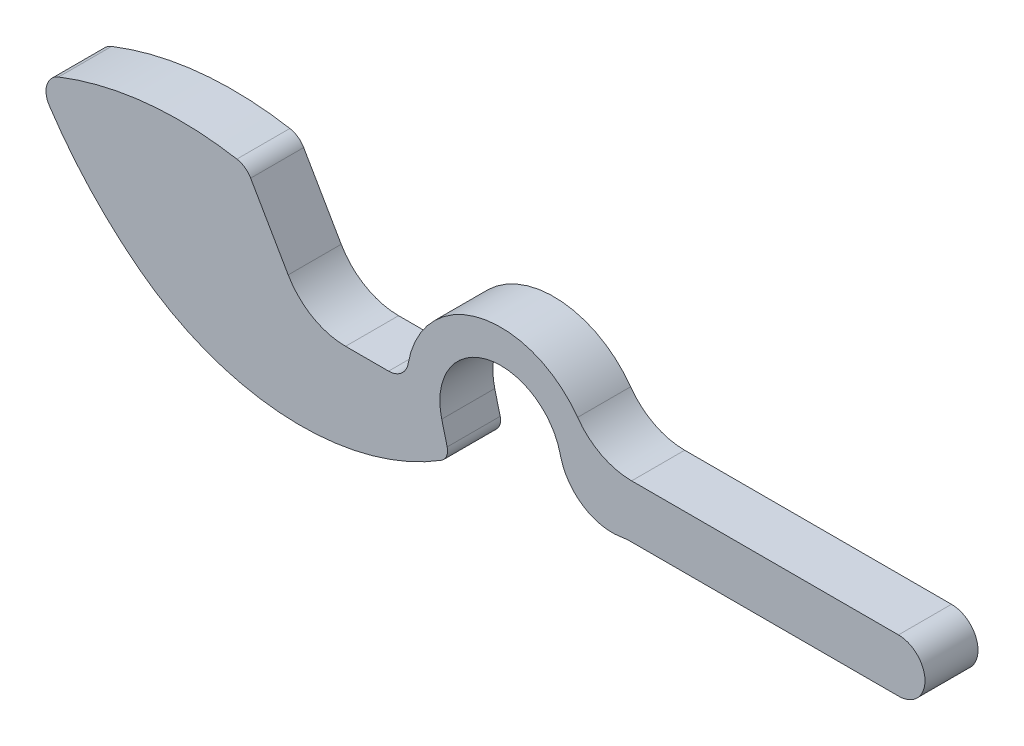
ISO-10303-21;
HEADER;
FILE_DESCRIPTION(('STEP AP214'),'2;1');
FILE_NAME('part.step','',(''),(''),'','','');
FILE_SCHEMA(('AUTOMOTIVE_DESIGN { 1 0 10303 214 1 1 1 1 }'));
ENDSEC;
DATA;
#1=APPLICATION_CONTEXT('core data for automotive mechanical design processes');
#2=APPLICATION_PROTOCOL_DEFINITION('international standard','automotive_design',2000,#1);
#3=PRODUCT_CONTEXT('',#1,'mechanical');
#4=PRODUCT('Part','Part','',(#3));
#5=PRODUCT_RELATED_PRODUCT_CATEGORY('part','',(#4));
#6=PRODUCT_DEFINITION_FORMATION('','',#4);
#7=PRODUCT_DEFINITION_CONTEXT('part definition',#1,'design');
#8=PRODUCT_DEFINITION('design','',#6,#7);
#9=PRODUCT_DEFINITION_SHAPE('','',#8);
#10=(LENGTH_UNIT() NAMED_UNIT(*) SI_UNIT(.MILLI.,.METRE.));
#11=(NAMED_UNIT(*) PLANE_ANGLE_UNIT() SI_UNIT($,.RADIAN.));
#12=(NAMED_UNIT(*) SI_UNIT($,.STERADIAN.) SOLID_ANGLE_UNIT());
#13=UNCERTAINTY_MEASURE_WITH_UNIT(LENGTH_MEASURE(1.E-05),#10,'distance_accuracy_value','');
#14=(GEOMETRIC_REPRESENTATION_CONTEXT(3) GLOBAL_UNCERTAINTY_ASSIGNED_CONTEXT((#13)) GLOBAL_UNIT_ASSIGNED_CONTEXT((#10,
#11,#12)) REPRESENTATION_CONTEXT('',''));
#15=CARTESIAN_POINT('',(0.,0.,0.));
#16=DIRECTION('',(0.,0.,1.));
#17=DIRECTION('',(1.,0.,0.));
#18=AXIS2_PLACEMENT_3D('',#15,#16,#17);
#19=CARTESIAN_POINT('',(29.4701025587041,-5.39818533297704,-136.148176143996));
#20=DIRECTION('',(0.,0.,1.));
#21=DIRECTION('',(1.,0.,0.));
#22=AXIS2_PLACEMENT_3D('',#19,#20,#21);
#23=CYLINDRICAL_SURFACE('',#22,60.);
#24=CARTESIAN_POINT('',(29.4701025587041,-5.39818533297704,1.));
#25=DIRECTION('',(0.,0.,1.));
#26=DIRECTION('',(1.,0.,0.));
#27=AXIS2_PLACEMENT_3D('',#24,#25,#26);
#28=CIRCLE('',#27,60.);
#29=CARTESIAN_POINT('',(-7.03735193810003,-53.0133695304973,0.999999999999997));
#30=VERTEX_POINT('',#29);
#31=CARTESIAN_POINT('',(-20.6369281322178,-38.4025104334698,1.));
#32=VERTEX_POINT('',#31);
#33=EDGE_CURVE('E174',#30,#32,#28,.F.);
#34=ORIENTED_EDGE('',*,*,#33,.F.);
#35=DIRECTION('',(0.,0.,1.));
#36=VECTOR('',#35,1.);
#37=CARTESIAN_POINT('',(-7.03735193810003,-53.0133695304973,0.999999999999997));
#38=LINE('',#37,#36);
#39=CARTESIAN_POINT('',(-7.03735193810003,-53.0133695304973,8.99999999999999));
#40=VERTEX_POINT('',#39);
#41=EDGE_CURVE('E180',#30,#40,#38,.T.);
#42=ORIENTED_EDGE('',*,*,#41,.T.);
#43=CARTESIAN_POINT('',(29.4701025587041,-5.39818533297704,8.99999999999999));
#44=DIRECTION('',(0.,0.,1.));
#45=DIRECTION('',(1.,0.,0.));
#46=AXIS2_PLACEMENT_3D('',#43,#44,#45);
#47=CIRCLE('',#46,60.);
#48=CARTESIAN_POINT('',(-20.6369281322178,-38.4025104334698,8.99999999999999));
#49=VERTEX_POINT('',#48);
#50=EDGE_CURVE('E238',#49,#40,#47,.T.);
#51=ORIENTED_EDGE('',*,*,#50,.F.);
#52=DIRECTION('',(0.,0.,1.));
#53=VECTOR('',#52,1.);
#54=CARTESIAN_POINT('',(-20.6369281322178,-38.4025104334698,-136.148176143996));
#55=LINE('',#54,#53);
#56=EDGE_CURVE('E191',#32,#49,#55,.T.);
#57=ORIENTED_EDGE('',*,*,#56,.F.);
#58=EDGE_LOOP('',(#34,#42,#51,#57));
#59=FACE_BOUND('',#58,.T.);
#60=ADVANCED_FACE('F35',(#59),#23,.T.);
#61=CARTESIAN_POINT('',(47.5,-47.5,50.1636651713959));
#62=DIRECTION('',(0.,0.,-1.));
#63=DIRECTION('',(-1.,0.,0.));
#64=AXIS2_PLACEMENT_3D('',#61,#62,#63);
#65=CYLINDRICAL_SURFACE('',#64,14.2);
#66=DIRECTION('',(0.,0.,1.));
#67=VECTOR('',#66,1.);
#68=CARTESIAN_POINT('',(59.0825649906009,-39.2851239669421,-136.148176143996));
#69=LINE('',#68,#67);
#70=CARTESIAN_POINT('',(59.0825649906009,-39.2851239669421,1.));
#71=VERTEX_POINT('',#70);
#72=CARTESIAN_POINT('',(59.0825649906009,-39.2851239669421,8.99999999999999));
#73=VERTEX_POINT('',#72);
#74=EDGE_CURVE('E257',#71,#73,#69,.T.);
#75=ORIENTED_EDGE('',*,*,#74,.F.);
#76=CARTESIAN_POINT('',(47.5,-47.5,0.999999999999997));
#77=DIRECTION('',(0.,0.,1.));
#78=DIRECTION('',(1.,0.,0.));
#79=AXIS2_PLACEMENT_3D('',#76,#77,#78);
#80=CIRCLE('',#79,14.2);
#81=CARTESIAN_POINT('',(33.5176633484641,-45.0232558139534,1.));
#82=VERTEX_POINT('',#81);
#83=EDGE_CURVE('E272',#71,#82,#80,.T.);
#84=ORIENTED_EDGE('',*,*,#83,.T.);
#85=DIRECTION('',(0.,0.,1.));
#86=VECTOR('',#85,1.);
#87=CARTESIAN_POINT('',(33.5176633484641,-45.0232558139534,-136.148176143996));
#88=LINE('',#87,#86);
#89=CARTESIAN_POINT('',(33.5176633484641,-45.0232558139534,9.00000000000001));
#90=VERTEX_POINT('',#89);
#91=EDGE_CURVE('E255',#82,#90,#88,.T.);
#92=ORIENTED_EDGE('',*,*,#91,.T.);
#93=CARTESIAN_POINT('',(47.5,-47.5,8.99999999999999));
#94=DIRECTION('',(0.,0.,1.));
#95=DIRECTION('',(1.,0.,0.));
#96=AXIS2_PLACEMENT_3D('',#93,#94,#95);
#97=CIRCLE('',#96,14.2);
#98=EDGE_CURVE('E268',#73,#90,#97,.T.);
#99=ORIENTED_EDGE('',*,*,#98,.F.);
#100=EDGE_LOOP('',(#75,#84,#92,#99));
#101=FACE_BOUND('',#100,.T.);
#102=ADVANCED_FACE('F355',(#101),#65,.T.);
#103=CARTESIAN_POINT('',(47.5,-47.5,0.999999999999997));
#104=DIRECTION('',(0.,0.,1.));
#105=DIRECTION('',(1.,0.,0.));
#106=AXIS2_PLACEMENT_3D('',#103,#104,#105);
#107=PLANE('',#106);
#108=DIRECTION('',(0.246517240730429,-0.969138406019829,0.));
#109=VECTOR('',#108,1.);
#110=CARTESIAN_POINT('',(38.5839266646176,-49.7679586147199,0.999999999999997));
#111=LINE('',#110,#109);
#112=CARTESIAN_POINT('',(38.5839266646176,-49.7679586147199,0.999999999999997));
#113=VERTEX_POINT('',#112);
#114=CARTESIAN_POINT('',(39.4025437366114,-52.9862051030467,0.999999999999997));
#115=VERTEX_POINT('',#114);
#116=EDGE_CURVE('E294',#113,#115,#111,.T.);
#117=ORIENTED_EDGE('',*,*,#116,.T.);
#118=CARTESIAN_POINT('',(37.4642669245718,-53.4792395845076,0.999999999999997));
#119=DIRECTION('',(0.,0.,1.));
#120=DIRECTION('',(1.,0.,0.));
#121=AXIS2_PLACEMENT_3D('',#118,#119,#120);
#122=CIRCLE('',#121,2.);
#123=CARTESIAN_POINT('',(38.5254940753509,-55.1744672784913,0.999999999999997));
#124=VERTEX_POINT('',#123);
#125=EDGE_CURVE('E12',#115,#124,#122,.F.);
#126=ORIENTED_EDGE('',*,*,#125,.T.);
#127=CARTESIAN_POINT('',(17.3009510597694,-21.2699133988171,0.999999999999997));
#128=DIRECTION('',(0.,0.,-1.));
#129=DIRECTION('',(1.,0.,0.));
#130=AXIS2_PLACEMENT_3D('',#127,#128,#129);
#131=CIRCLE('',#130,40.);
#132=EDGE_CURVE('E170',#124,#30,#131,.T.);
#133=ORIENTED_EDGE('',*,*,#132,.T.);
#134=ORIENTED_EDGE('',*,*,#33,.T.);
#135=CARTESIAN_POINT('',(-18.1315765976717,-36.7522941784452,1.));
#136=DIRECTION('',(0.,0.,1.));
#137=DIRECTION('',(1.,0.,0.));
#138=AXIS2_PLACEMENT_3D('',#135,#136,#137);
#139=CIRCLE('',#138,3.);
#140=CARTESIAN_POINT('',(-19.2295508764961,-33.9604395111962,1.));
#141=VERTEX_POINT('',#140);
#142=EDGE_CURVE('E193',#32,#141,#139,.F.);
#143=ORIENTED_EDGE('',*,*,#142,.T.);
#144=CARTESIAN_POINT('',(-0.929979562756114,-80.4913506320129,1.));
#145=DIRECTION('',(0.,0.,1.));
#146=DIRECTION('',(1.,0.,0.));
#147=AXIS2_PLACEMENT_3D('',#144,#145,#146);
#148=CIRCLE('',#147,50.);
#149=CARTESIAN_POINT('',(7.66810578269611,-31.236168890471,1.));
#150=VERTEX_POINT('',#149);
#151=EDGE_CURVE('E198',#141,#150,#148,.F.);
#152=ORIENTED_EDGE('',*,*,#151,.T.);
#153=CARTESIAN_POINT('',(7.15222066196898,-34.1914797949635,1.));
#154=DIRECTION('',(0.,0.,1.));
#155=DIRECTION('',(1.,0.,0.));
#156=AXIS2_PLACEMENT_3D('',#153,#154,#155);
#157=CIRCLE('',#156,2.99999999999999);
#158=CARTESIAN_POINT('',(9.7502968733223,-32.6914797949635,1.));
#159=VERTEX_POINT('',#158);
#160=EDGE_CURVE('E320',#150,#159,#157,.F.);
#161=ORIENTED_EDGE('',*,*,#160,.T.);
#162=DIRECTION('',(0.499999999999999,-0.866025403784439,0.));
#163=VECTOR('',#162,1.);
#164=CARTESIAN_POINT('',(15.4132486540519,-42.4999999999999,1.));
#165=LINE('',#164,#163);
#166=CARTESIAN_POINT('',(15.4132486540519,-42.4999999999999,1.));
#167=VERTEX_POINT('',#166);
#168=EDGE_CURVE('E318',#159,#167,#165,.T.);
#169=ORIENTED_EDGE('',*,*,#168,.T.);
#170=CARTESIAN_POINT('',(24.0735026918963,-37.5,1.));
#171=DIRECTION('',(0.,0.,1.));
#172=DIRECTION('',(1.,0.,0.));
#173=AXIS2_PLACEMENT_3D('',#170,#171,#172);
#174=CIRCLE('',#173,9.99999999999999);
#175=CARTESIAN_POINT('',(24.0735026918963,-47.5,1.));
#176=VERTEX_POINT('',#175);
#177=EDGE_CURVE('E316',#167,#176,#174,.T.);
#178=ORIENTED_EDGE('',*,*,#177,.T.);
#179=DIRECTION('',(1.,0.,0.));
#180=VECTOR('',#179,1.);
#181=CARTESIAN_POINT('',(30.5636485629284,-47.5,1.));
#182=LINE('',#181,#180);
#183=CARTESIAN_POINT('',(30.5636485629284,-47.5,1.));
#184=VERTEX_POINT('',#183);
#185=EDGE_CURVE('E314',#176,#184,#182,.T.);
#186=ORIENTED_EDGE('',*,*,#185,.T.);
#187=CARTESIAN_POINT('',(30.5636485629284,-44.5,1.));
#188=DIRECTION('',(0.,0.,1.));
#189=DIRECTION('',(1.,0.,0.));
#190=AXIS2_PLACEMENT_3D('',#187,#188,#189);
#191=CIRCLE('',#190,3.);
#192=EDGE_CURVE('E311',#184,#82,#191,.T.);
#193=ORIENTED_EDGE('',*,*,#192,.T.);
#194=ORIENTED_EDGE('',*,*,#83,.F.);
#195=CARTESIAN_POINT('',(67.2393008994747,-33.4999999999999,1.));
#196=DIRECTION('',(0.,0.,1.));
#197=DIRECTION('',(1.,0.,0.));
#198=AXIS2_PLACEMENT_3D('',#195,#196,#197);
#199=CIRCLE('',#198,10.);
#200=CARTESIAN_POINT('',(67.2393008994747,-43.5,1.));
#201=VERTEX_POINT('',#200);
#202=EDGE_CURVE('E309',#71,#201,#199,.T.);
#203=ORIENTED_EDGE('',*,*,#202,.T.);
#204=DIRECTION('',(1.,0.,0.));
#205=VECTOR('',#204,1.);
#206=CARTESIAN_POINT('',(67.2393008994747,-43.5,1.));
#207=LINE('',#206,#205);
#208=CARTESIAN_POINT('',(107.5,-43.5,1.));
#209=VERTEX_POINT('',#208);
#210=EDGE_CURVE('E307',#201,#209,#207,.T.);
#211=ORIENTED_EDGE('',*,*,#210,.T.);
#212=CARTESIAN_POINT('',(107.5,-47.5,1.));
#213=DIRECTION('',(0.,0.,1.));
#214=DIRECTION('',(1.,0.,0.));
#215=AXIS2_PLACEMENT_3D('',#212,#213,#214);
#216=CIRCLE('',#215,4.);
#217=CARTESIAN_POINT('',(107.5,-51.5,1.));
#218=VERTEX_POINT('',#217);
#219=EDGE_CURVE('E242',#209,#218,#216,.F.);
#220=ORIENTED_EDGE('',*,*,#219,.T.);
#221=DIRECTION('',(-1.,0.,0.));
#222=VECTOR('',#221,1.);
#223=CARTESIAN_POINT('',(67.2393008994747,-51.5,1.));
#224=LINE('',#223,#222);
#225=CARTESIAN_POINT('',(67.2393008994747,-51.5,1.));
#226=VERTEX_POINT('',#225);
#227=EDGE_CURVE('E196',#218,#226,#224,.T.);
#228=ORIENTED_EDGE('',*,*,#227,.T.);
#229=CARTESIAN_POINT('',(67.2393008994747,-61.5,1.));
#230=DIRECTION('',(0.,0.,1.));
#231=DIRECTION('',(1.,0.,0.));
#232=AXIS2_PLACEMENT_3D('',#229,#230,#231);
#233=CIRCLE('',#232,10.);
#234=CARTESIAN_POINT('',(65.601936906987,-51.6349587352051,1.));
#235=VERTEX_POINT('',#234);
#236=EDGE_CURVE('E192',#226,#235,#233,.T.);
#237=ORIENTED_EDGE('',*,*,#236,.T.);
#238=CARTESIAN_POINT('',(64.2920457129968,-43.7429257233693,1.));
#239=DIRECTION('',(0.,0.,1.));
#240=DIRECTION('',(1.,0.,0.));
#241=AXIS2_PLACEMENT_3D('',#238,#239,#240);
#242=CIRCLE('',#241,8.);
#243=CARTESIAN_POINT('',(56.5389384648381,-45.7150636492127,0.999999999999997));
#244=VERTEX_POINT('',#243);
#245=EDGE_CURVE('E286',#235,#244,#242,.F.);
#246=ORIENTED_EDGE('',*,*,#245,.T.);
#247=DIRECTION('',(-0.246517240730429,0.969138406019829,0.));
#248=VECTOR('',#247,1.);
#249=CARTESIAN_POINT('',(56.4160733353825,-45.23204138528,0.999999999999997));
#250=LINE('',#249,#248);
#251=CARTESIAN_POINT('',(56.4160733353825,-45.23204138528,0.999999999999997));
#252=VERTEX_POINT('',#251);
#253=EDGE_CURVE('E296',#244,#252,#250,.T.);
#254=ORIENTED_EDGE('',*,*,#253,.T.);
#255=CARTESIAN_POINT('',(47.5,-47.5,0.999999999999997));
#256=DIRECTION('',(0.,0.,1.));
#257=DIRECTION('',(1.,0.,0.));
#258=AXIS2_PLACEMENT_3D('',#255,#256,#257);
#259=CIRCLE('',#258,9.2);
#260=EDGE_CURVE('E273',#252,#113,#259,.T.);
#261=ORIENTED_EDGE('',*,*,#260,.T.);
#262=EDGE_LOOP('',(#117,#126,#133,#134,#143,#152,#161,#169,#178,#186,#193,#194,#203,#211,#220,
#228,#237,#246,#254,#261));
#263=FACE_BOUND('',#262,.T.);
#264=ADVANCED_FACE('F172',(#263),#107,.F.);
#265=CARTESIAN_POINT('',(47.5,-47.5,50.1636651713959));
#266=DIRECTION('',(0.,0.,-1.));
#267=DIRECTION('',(-1.,0.,0.));
#268=AXIS2_PLACEMENT_3D('',#265,#266,#267);
#269=CYLINDRICAL_SURFACE('',#268,9.2);
#270=DIRECTION('',(0.,0.,1.));
#271=VECTOR('',#270,1.);
#272=CARTESIAN_POINT('',(56.4160733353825,-45.23204138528,0.999999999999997));
#273=LINE('',#272,#271);
#274=CARTESIAN_POINT('',(56.4160733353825,-45.23204138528,8.99999999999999));
#275=VERTEX_POINT('',#274);
#276=EDGE_CURVE('E205',#252,#275,#273,.T.);
#277=ORIENTED_EDGE('',*,*,#276,.T.);
#278=CARTESIAN_POINT('',(47.5,-47.5,8.99999999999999));
#279=DIRECTION('',(0.,0.,1.));
#280=DIRECTION('',(1.,0.,0.));
#281=AXIS2_PLACEMENT_3D('',#278,#279,#280);
#282=CIRCLE('',#281,9.2);
#283=CARTESIAN_POINT('',(38.5839266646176,-49.7679586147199,8.99999999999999));
#284=VERTEX_POINT('',#283);
#285=EDGE_CURVE('E276',#275,#284,#282,.T.);
#286=ORIENTED_EDGE('',*,*,#285,.T.);
#287=DIRECTION('',(0.,0.,1.));
#288=VECTOR('',#287,1.);
#289=CARTESIAN_POINT('',(38.5839266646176,-49.7679586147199,0.999999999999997));
#290=LINE('',#289,#288);
#291=EDGE_CURVE('E299',#113,#284,#290,.T.);
#292=ORIENTED_EDGE('',*,*,#291,.F.);
#293=ORIENTED_EDGE('',*,*,#260,.F.);
#294=EDGE_LOOP('',(#277,#286,#292,#293));
#295=FACE_BOUND('',#294,.T.);
#296=ADVANCED_FACE('F394',(#295),#269,.F.);
#297=CARTESIAN_POINT('',(25.2,-37.5,8.99999999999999));
#298=DIRECTION('',(0.,0.,1.));
#299=DIRECTION('',(1.,0.,0.));
#300=AXIS2_PLACEMENT_3D('',#297,#298,#299);
#301=PLANE('',#300);
#302=CARTESIAN_POINT('',(17.3009510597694,-21.2699133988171,8.99999999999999));
#303=DIRECTION('',(0.,0.,-1.));
#304=DIRECTION('',(1.,0.,0.));
#305=AXIS2_PLACEMENT_3D('',#302,#303,#304);
#306=CIRCLE('',#305,40.);
#307=CARTESIAN_POINT('',(38.5254940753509,-55.1744672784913,8.99999999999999));
#308=VERTEX_POINT('',#307);
#309=EDGE_CURVE('E181',#308,#40,#306,.T.);
#310=ORIENTED_EDGE('',*,*,#309,.F.);
#311=CARTESIAN_POINT('',(37.4642669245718,-53.4792395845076,8.99999999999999));
#312=DIRECTION('',(0.,0.,1.));
#313=DIRECTION('',(1.,0.,0.));
#314=AXIS2_PLACEMENT_3D('',#311,#312,#313);
#315=CIRCLE('',#314,2.);
#316=CARTESIAN_POINT('',(39.4025437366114,-52.9862051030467,8.99999999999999));
#317=VERTEX_POINT('',#316);
#318=EDGE_CURVE('E57',#308,#317,#315,.T.);
#319=ORIENTED_EDGE('',*,*,#318,.T.);
#320=DIRECTION('',(0.246517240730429,-0.969138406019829,0.));
#321=VECTOR('',#320,1.);
#322=CARTESIAN_POINT('',(38.5839266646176,-49.7679586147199,8.99999999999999));
#323=LINE('',#322,#321);
#324=EDGE_CURVE('E188',#284,#317,#323,.T.);
#325=ORIENTED_EDGE('',*,*,#324,.F.);
#326=ORIENTED_EDGE('',*,*,#285,.F.);
#327=DIRECTION('',(-0.246517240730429,0.969138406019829,0.));
#328=VECTOR('',#327,1.);
#329=CARTESIAN_POINT('',(56.4160733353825,-45.23204138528,8.99999999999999));
#330=LINE('',#329,#328);
#331=CARTESIAN_POINT('',(56.5389384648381,-45.7150636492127,8.99999999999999));
#332=VERTEX_POINT('',#331);
#333=EDGE_CURVE('E297',#332,#275,#330,.T.);
#334=ORIENTED_EDGE('',*,*,#333,.F.);
#335=CARTESIAN_POINT('',(64.2920457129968,-43.7429257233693,9.00000000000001));
#336=DIRECTION('',(0.,0.,1.));
#337=DIRECTION('',(1.,0.,0.));
#338=AXIS2_PLACEMENT_3D('',#335,#336,#337);
#339=CIRCLE('',#338,8.);
#340=CARTESIAN_POINT('',(65.601936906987,-51.6349587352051,8.99999999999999));
#341=VERTEX_POINT('',#340);
#342=EDGE_CURVE('E282',#332,#341,#339,.T.);
#343=ORIENTED_EDGE('',*,*,#342,.T.);
#344=CARTESIAN_POINT('',(67.2393008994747,-61.5,8.99999999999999));
#345=DIRECTION('',(0.,0.,-1.));
#346=DIRECTION('',(1.,0.,0.));
#347=AXIS2_PLACEMENT_3D('',#344,#345,#346);
#348=CIRCLE('',#347,10.);
#349=CARTESIAN_POINT('',(67.2393008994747,-51.5,8.99999999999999));
#350=VERTEX_POINT('',#349);
#351=EDGE_CURVE('E202',#341,#350,#348,.T.);
#352=ORIENTED_EDGE('',*,*,#351,.T.);
#353=DIRECTION('',(1.,0.,0.));
#354=VECTOR('',#353,1.);
#355=CARTESIAN_POINT('',(67.2393008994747,-51.5,8.99999999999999));
#356=LINE('',#355,#354);
#357=CARTESIAN_POINT('',(107.5,-51.5,8.99999999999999));
#358=VERTEX_POINT('',#357);
#359=EDGE_CURVE('E204',#350,#358,#356,.T.);
#360=ORIENTED_EDGE('',*,*,#359,.T.);
#361=CARTESIAN_POINT('',(107.5,-47.5,8.99999999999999));
#362=DIRECTION('',(0.,0.,1.));
#363=DIRECTION('',(1.,0.,0.));
#364=AXIS2_PLACEMENT_3D('',#361,#362,#363);
#365=CIRCLE('',#364,4.);
#366=CARTESIAN_POINT('',(107.5,-43.5,8.99999999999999));
#367=VERTEX_POINT('',#366);
#368=EDGE_CURVE('E208',#358,#367,#365,.T.);
#369=ORIENTED_EDGE('',*,*,#368,.T.);
#370=DIRECTION('',(-1.,0.,0.));
#371=VECTOR('',#370,1.);
#372=CARTESIAN_POINT('',(67.2393008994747,-43.5,8.99999999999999));
#373=LINE('',#372,#371);
#374=CARTESIAN_POINT('',(67.2393008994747,-43.5,8.99999999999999));
#375=VERTEX_POINT('',#374);
#376=EDGE_CURVE('E211',#367,#375,#373,.T.);
#377=ORIENTED_EDGE('',*,*,#376,.T.);
#378=CARTESIAN_POINT('',(67.2393008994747,-33.4999999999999,8.99999999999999));
#379=DIRECTION('',(0.,0.,-1.));
#380=DIRECTION('',(1.,0.,0.));
#381=AXIS2_PLACEMENT_3D('',#378,#379,#380);
#382=CIRCLE('',#381,10.);
#383=EDGE_CURVE('E214',#375,#73,#382,.T.);
#384=ORIENTED_EDGE('',*,*,#383,.T.);
#385=ORIENTED_EDGE('',*,*,#98,.T.);
#386=CARTESIAN_POINT('',(30.5636485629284,-44.5,8.99999999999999));
#387=DIRECTION('',(0.,0.,-1.));
#388=DIRECTION('',(1.,0.,0.));
#389=AXIS2_PLACEMENT_3D('',#386,#387,#388);
#390=CIRCLE('',#389,3.);
#391=CARTESIAN_POINT('',(30.5636485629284,-47.5,8.99999999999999));
#392=VERTEX_POINT('',#391);
#393=EDGE_CURVE('E217',#90,#392,#390,.T.);
#394=ORIENTED_EDGE('',*,*,#393,.T.);
#395=DIRECTION('',(-1.,0.,0.));
#396=VECTOR('',#395,1.);
#397=CARTESIAN_POINT('',(30.5636485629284,-47.5,8.99999999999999));
#398=LINE('',#397,#396);
#399=CARTESIAN_POINT('',(24.0735026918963,-47.5,8.99999999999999));
#400=VERTEX_POINT('',#399);
#401=EDGE_CURVE('E220',#392,#400,#398,.T.);
#402=ORIENTED_EDGE('',*,*,#401,.T.);
#403=CARTESIAN_POINT('',(24.0735026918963,-37.5,8.99999999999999));
#404=DIRECTION('',(0.,0.,-1.));
#405=DIRECTION('',(-1.,0.,0.));
#406=AXIS2_PLACEMENT_3D('',#403,#404,#405);
#407=CIRCLE('',#406,9.99999999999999);
#408=CARTESIAN_POINT('',(15.4132486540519,-42.4999999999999,8.99999999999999));
#409=VERTEX_POINT('',#408);
#410=EDGE_CURVE('E223',#400,#409,#407,.T.);
#411=ORIENTED_EDGE('',*,*,#410,.T.);
#412=DIRECTION('',(-0.499999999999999,0.866025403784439,0.));
#413=VECTOR('',#412,1.);
#414=CARTESIAN_POINT('',(15.4132486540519,-42.4999999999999,8.99999999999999));
#415=LINE('',#414,#413);
#416=CARTESIAN_POINT('',(9.7502968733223,-32.6914797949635,8.99999999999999));
#417=VERTEX_POINT('',#416);
#418=EDGE_CURVE('E226',#409,#417,#415,.T.);
#419=ORIENTED_EDGE('',*,*,#418,.T.);
#420=CARTESIAN_POINT('',(7.15222066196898,-34.1914797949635,8.99999999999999));
#421=DIRECTION('',(0.,0.,1.));
#422=DIRECTION('',(1.,0.,0.));
#423=AXIS2_PLACEMENT_3D('',#420,#421,#422);
#424=CIRCLE('',#423,2.99999999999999);
#425=CARTESIAN_POINT('',(7.66810578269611,-31.236168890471,8.99999999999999));
#426=VERTEX_POINT('',#425);
#427=EDGE_CURVE('E229',#417,#426,#424,.T.);
#428=ORIENTED_EDGE('',*,*,#427,.T.);
#429=CARTESIAN_POINT('',(-0.929979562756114,-80.4913506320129,8.99999999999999));
#430=DIRECTION('',(0.,0.,1.));
#431=DIRECTION('',(1.,0.,0.));
#432=AXIS2_PLACEMENT_3D('',#429,#430,#431);
#433=CIRCLE('',#432,50.);
#434=CARTESIAN_POINT('',(-19.2295508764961,-33.9604395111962,8.99999999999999));
#435=VERTEX_POINT('',#434);
#436=EDGE_CURVE('E232',#426,#435,#433,.T.);
#437=ORIENTED_EDGE('',*,*,#436,.T.);
#438=CARTESIAN_POINT('',(-18.1315765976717,-36.7522941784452,8.99999999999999));
#439=DIRECTION('',(0.,0.,1.));
#440=DIRECTION('',(-1.,0.,0.));
#441=AXIS2_PLACEMENT_3D('',#438,#439,#440);
#442=CIRCLE('',#441,3.);
#443=EDGE_CURVE('E235',#435,#49,#442,.T.);
#444=ORIENTED_EDGE('',*,*,#443,.T.);
#445=ORIENTED_EDGE('',*,*,#50,.T.);
#446=EDGE_LOOP('',(#310,#319,#325,#326,#334,#343,#352,#360,#369,#377,#384,#385,#394,#402,#411,
#419,#428,#437,#444,#445));
#447=FACE_BOUND('',#446,.T.);
#448=ADVANCED_FACE('F291',(#447),#301,.T.);
#449=CARTESIAN_POINT('',(67.2393008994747,-51.5,-136.148176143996));
#450=DIRECTION('',(0.,-1.,0.));
#451=DIRECTION('',(0.,0.,-1.));
#452=AXIS2_PLACEMENT_3D('',#449,#450,#451);
#453=PLANE('',#452);
#454=ORIENTED_EDGE('',*,*,#227,.F.);
#455=DIRECTION('',(0.,0.,1.));
#456=VECTOR('',#455,1.);
#457=CARTESIAN_POINT('',(107.5,-51.5,-136.148176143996));
#458=LINE('',#457,#456);
#459=EDGE_CURVE('E264',#218,#358,#458,.T.);
#460=ORIENTED_EDGE('',*,*,#459,.T.);
#461=ORIENTED_EDGE('',*,*,#359,.F.);
#462=DIRECTION('',(0.,0.,1.));
#463=VECTOR('',#462,1.);
#464=CARTESIAN_POINT('',(67.2393008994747,-51.5,-136.148176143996));
#465=LINE('',#464,#463);
#466=EDGE_CURVE('E240',#226,#350,#465,.T.);
#467=ORIENTED_EDGE('',*,*,#466,.F.);
#468=EDGE_LOOP('',(#454,#460,#461,#467));
#469=FACE_BOUND('',#468,.T.);
#470=ADVANCED_FACE('F381',(#469),#453,.T.);
#471=CARTESIAN_POINT('',(107.5,-47.5,-136.148176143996));
#472=DIRECTION('',(0.,0.,1.));
#473=DIRECTION('',(1.,0.,0.));
#474=AXIS2_PLACEMENT_3D('',#471,#472,#473);
#475=CYLINDRICAL_SURFACE('',#474,4.);
#476=ORIENTED_EDGE('',*,*,#219,.F.);
#477=DIRECTION('',(0.,0.,1.));
#478=VECTOR('',#477,1.);
#479=CARTESIAN_POINT('',(107.5,-43.5,-136.148176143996));
#480=LINE('',#479,#478);
#481=EDGE_CURVE('E262',#209,#367,#480,.T.);
#482=ORIENTED_EDGE('',*,*,#481,.T.);
#483=ORIENTED_EDGE('',*,*,#368,.F.);
#484=ORIENTED_EDGE('',*,*,#459,.F.);
#485=EDGE_LOOP('',(#476,#482,#483,#484));
#486=FACE_BOUND('',#485,.T.);
#487=ADVANCED_FACE('F369',(#486),#475,.T.);
#488=CARTESIAN_POINT('',(67.2393008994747,-43.5,-136.148176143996));
#489=DIRECTION('',(0.,1.,0.));
#490=DIRECTION('',(0.,0.,1.));
#491=AXIS2_PLACEMENT_3D('',#488,#489,#490);
#492=PLANE('',#491);
#493=ORIENTED_EDGE('',*,*,#210,.F.);
#494=DIRECTION('',(0.,0.,1.));
#495=VECTOR('',#494,1.);
#496=CARTESIAN_POINT('',(67.2393008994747,-43.5,-136.148176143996));
#497=LINE('',#496,#495);
#498=EDGE_CURVE('E260',#201,#375,#497,.T.);
#499=ORIENTED_EDGE('',*,*,#498,.T.);
#500=ORIENTED_EDGE('',*,*,#376,.F.);
#501=ORIENTED_EDGE('',*,*,#481,.F.);
#502=EDGE_LOOP('',(#493,#499,#500,#501));
#503=FACE_BOUND('',#502,.T.);
#504=ADVANCED_FACE('F366',(#503),#492,.T.);
#505=CARTESIAN_POINT('',(67.2393008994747,-61.5,-136.148176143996));
#506=DIRECTION('',(0.,0.,1.));
#507=DIRECTION('',(1.,0.,0.));
#508=AXIS2_PLACEMENT_3D('',#505,#506,#507);
#509=CYLINDRICAL_SURFACE('',#508,10.);
#510=ORIENTED_EDGE('',*,*,#351,.F.);
#511=DIRECTION('',(0.,0.,1.));
#512=VECTOR('',#511,1.);
#513=CARTESIAN_POINT('',(65.601936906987,-51.6349587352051,-136.148176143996));
#514=LINE('',#513,#512);
#515=EDGE_CURVE('E284',#341,#235,#514,.F.);
#516=ORIENTED_EDGE('',*,*,#515,.T.);
#517=ORIENTED_EDGE('',*,*,#236,.F.);
#518=ORIENTED_EDGE('',*,*,#466,.T.);
#519=EDGE_LOOP('',(#510,#516,#517,#518));
#520=FACE_BOUND('',#519,.T.);
#521=ADVANCED_FACE('F378',(#520),#509,.F.);
#522=CARTESIAN_POINT('',(67.2393008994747,-33.4999999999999,-136.148176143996));
#523=DIRECTION('',(0.,0.,1.));
#524=DIRECTION('',(1.,0.,0.));
#525=AXIS2_PLACEMENT_3D('',#522,#523,#524);
#526=CYLINDRICAL_SURFACE('',#525,10.);
#527=ORIENTED_EDGE('',*,*,#202,.F.);
#528=ORIENTED_EDGE('',*,*,#74,.T.);
#529=ORIENTED_EDGE('',*,*,#383,.F.);
#530=ORIENTED_EDGE('',*,*,#498,.F.);
#531=EDGE_LOOP('',(#527,#528,#529,#530));
#532=FACE_BOUND('',#531,.T.);
#533=ADVANCED_FACE('F361',(#532),#526,.F.);
#534=CARTESIAN_POINT('',(30.5636485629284,-44.5,-136.148176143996));
#535=DIRECTION('',(0.,0.,1.));
#536=DIRECTION('',(1.,0.,0.));
#537=AXIS2_PLACEMENT_3D('',#534,#535,#536);
#538=CYLINDRICAL_SURFACE('',#537,3.);
#539=ORIENTED_EDGE('',*,*,#192,.F.);
#540=DIRECTION('',(0.,0.,1.));
#541=VECTOR('',#540,1.);
#542=CARTESIAN_POINT('',(30.5636485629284,-47.5,-136.148176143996));
#543=LINE('',#542,#541);
#544=EDGE_CURVE('E253',#184,#392,#543,.T.);
#545=ORIENTED_EDGE('',*,*,#544,.T.);
#546=ORIENTED_EDGE('',*,*,#393,.F.);
#547=ORIENTED_EDGE('',*,*,#91,.F.);
#548=EDGE_LOOP('',(#539,#545,#546,#547));
#549=FACE_BOUND('',#548,.T.);
#550=ADVANCED_FACE('F351',(#549),#538,.F.);
#551=CARTESIAN_POINT('',(30.5636485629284,-47.5,-136.148176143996));
#552=DIRECTION('',(0.,1.,0.));
#553=DIRECTION('',(-1.,0.,0.));
#554=AXIS2_PLACEMENT_3D('',#551,#552,#553);
#555=PLANE('',#554);
#556=ORIENTED_EDGE('',*,*,#185,.F.);
#557=DIRECTION('',(0.,0.,1.));
#558=VECTOR('',#557,1.);
#559=CARTESIAN_POINT('',(24.0735026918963,-47.5,-136.148176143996));
#560=LINE('',#559,#558);
#561=EDGE_CURVE('E251',#176,#400,#560,.T.);
#562=ORIENTED_EDGE('',*,*,#561,.T.);
#563=ORIENTED_EDGE('',*,*,#401,.F.);
#564=ORIENTED_EDGE('',*,*,#544,.F.);
#565=EDGE_LOOP('',(#556,#562,#563,#564));
#566=FACE_BOUND('',#565,.T.);
#567=ADVANCED_FACE('F346',(#566),#555,.T.);
#568=CARTESIAN_POINT('',(24.0735026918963,-37.5,-136.148176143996));
#569=DIRECTION('',(0.,0.,1.));
#570=DIRECTION('',(1.,0.,0.));
#571=AXIS2_PLACEMENT_3D('',#568,#569,#570);
#572=CYLINDRICAL_SURFACE('',#571,9.99999999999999);
#573=ORIENTED_EDGE('',*,*,#177,.F.);
#574=DIRECTION('',(0.,0.,1.));
#575=VECTOR('',#574,1.);
#576=CARTESIAN_POINT('',(15.4132486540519,-42.4999999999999,-136.148176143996));
#577=LINE('',#576,#575);
#578=EDGE_CURVE('E249',#167,#409,#577,.T.);
#579=ORIENTED_EDGE('',*,*,#578,.T.);
#580=ORIENTED_EDGE('',*,*,#410,.F.);
#581=ORIENTED_EDGE('',*,*,#561,.F.);
#582=EDGE_LOOP('',(#573,#579,#580,#581));
#583=FACE_BOUND('',#582,.T.);
#584=ADVANCED_FACE('F343',(#583),#572,.F.);
#585=CARTESIAN_POINT('',(15.4132486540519,-42.4999999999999,-136.148176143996));
#586=DIRECTION('',(0.866025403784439,0.499999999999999,0.));
#587=DIRECTION('',(-0.499999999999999,0.866025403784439,0.));
#588=AXIS2_PLACEMENT_3D('',#585,#586,#587);
#589=PLANE('',#588);
#590=ORIENTED_EDGE('',*,*,#168,.F.);
#591=DIRECTION('',(0.,0.,1.));
#592=VECTOR('',#591,1.);
#593=CARTESIAN_POINT('',(9.7502968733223,-32.6914797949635,-136.148176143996));
#594=LINE('',#593,#592);
#595=EDGE_CURVE('E247',#159,#417,#594,.T.);
#596=ORIENTED_EDGE('',*,*,#595,.T.);
#597=ORIENTED_EDGE('',*,*,#418,.F.);
#598=ORIENTED_EDGE('',*,*,#578,.F.);
#599=EDGE_LOOP('',(#590,#596,#597,#598));
#600=FACE_BOUND('',#599,.T.);
#601=ADVANCED_FACE('F338',(#600),#589,.T.);
#602=CARTESIAN_POINT('',(7.15222066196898,-34.1914797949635,-136.148176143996));
#603=DIRECTION('',(0.,0.,1.));
#604=DIRECTION('',(1.,0.,0.));
#605=AXIS2_PLACEMENT_3D('',#602,#603,#604);
#606=CYLINDRICAL_SURFACE('',#605,2.99999999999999);
#607=ORIENTED_EDGE('',*,*,#160,.F.);
#608=DIRECTION('',(0.,0.,1.));
#609=VECTOR('',#608,1.);
#610=CARTESIAN_POINT('',(7.66810578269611,-31.236168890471,-136.148176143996));
#611=LINE('',#610,#609);
#612=EDGE_CURVE('E245',#150,#426,#611,.T.);
#613=ORIENTED_EDGE('',*,*,#612,.T.);
#614=ORIENTED_EDGE('',*,*,#427,.F.);
#615=ORIENTED_EDGE('',*,*,#595,.F.);
#616=EDGE_LOOP('',(#607,#613,#614,#615));
#617=FACE_BOUND('',#616,.T.);
#618=ADVANCED_FACE('F329',(#617),#606,.T.);
#619=CARTESIAN_POINT('',(-0.929979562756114,-80.4913506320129,-136.148176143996));
#620=DIRECTION('',(0.,0.,1.));
#621=DIRECTION('',(1.,0.,0.));
#622=AXIS2_PLACEMENT_3D('',#619,#620,#621);
#623=CYLINDRICAL_SURFACE('',#622,50.);
#624=ORIENTED_EDGE('',*,*,#151,.F.);
#625=DIRECTION('',(0.,0.,1.));
#626=VECTOR('',#625,1.);
#627=CARTESIAN_POINT('',(-19.2295508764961,-33.9604395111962,-136.148176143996));
#628=LINE('',#627,#626);
#629=EDGE_CURVE('E243',#141,#435,#628,.T.);
#630=ORIENTED_EDGE('',*,*,#629,.T.);
#631=ORIENTED_EDGE('',*,*,#436,.F.);
#632=ORIENTED_EDGE('',*,*,#612,.F.);
#633=EDGE_LOOP('',(#624,#630,#631,#632));
#634=FACE_BOUND('',#633,.T.);
#635=ADVANCED_FACE('F332',(#634),#623,.T.);
#636=CARTESIAN_POINT('',(-18.1315765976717,-36.7522941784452,-136.148176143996));
#637=DIRECTION('',(0.,0.,1.));
#638=DIRECTION('',(1.,0.,0.));
#639=AXIS2_PLACEMENT_3D('',#636,#637,#638);
#640=CYLINDRICAL_SURFACE('',#639,3.);
#641=ORIENTED_EDGE('',*,*,#142,.F.);
#642=ORIENTED_EDGE('',*,*,#56,.T.);
#643=ORIENTED_EDGE('',*,*,#443,.F.);
#644=ORIENTED_EDGE('',*,*,#629,.F.);
#645=EDGE_LOOP('',(#641,#642,#643,#644));
#646=FACE_BOUND('',#645,.T.);
#647=ADVANCED_FACE('F410',(#646),#640,.T.);
#648=CARTESIAN_POINT('',(38.5839266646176,-49.7679586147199,0.999999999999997));
#649=DIRECTION('',(-0.96913840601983,-0.246517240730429,0.));
#650=DIRECTION('',(0.246517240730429,-0.96913840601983,0.));
#651=AXIS2_PLACEMENT_3D('',#648,#649,#650);
#652=PLANE('',#651);
#653=ORIENTED_EDGE('',*,*,#324,.T.);
#654=DIRECTION('',(0.,0.,1.));
#655=VECTOR('',#654,1.);
#656=CARTESIAN_POINT('',(39.4025437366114,-52.9862051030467,0.999999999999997));
#657=LINE('',#656,#655);
#658=EDGE_CURVE('E43',#317,#115,#657,.F.);
#659=ORIENTED_EDGE('',*,*,#658,.T.);
#660=ORIENTED_EDGE('',*,*,#116,.F.);
#661=ORIENTED_EDGE('',*,*,#291,.T.);
#662=EDGE_LOOP('',(#653,#659,#660,#661));
#663=FACE_BOUND('',#662,.T.);
#664=ADVANCED_FACE('F408',(#663),#652,.F.);
#665=CARTESIAN_POINT('',(56.4160733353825,-45.23204138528,0.999999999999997));
#666=DIRECTION('',(0.969138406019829,0.246517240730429,0.));
#667=DIRECTION('',(-0.246517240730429,0.969138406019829,0.));
#668=AXIS2_PLACEMENT_3D('',#665,#666,#667);
#669=PLANE('',#668);
#670=ORIENTED_EDGE('',*,*,#253,.F.);
#671=DIRECTION('',(0.,0.,-1.));
#672=VECTOR('',#671,1.);
#673=CARTESIAN_POINT('',(56.5389384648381,-45.7150636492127,9.00000000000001));
#674=LINE('',#673,#672);
#675=EDGE_CURVE('E271',#244,#332,#674,.F.);
#676=ORIENTED_EDGE('',*,*,#675,.T.);
#677=ORIENTED_EDGE('',*,*,#333,.T.);
#678=ORIENTED_EDGE('',*,*,#276,.F.);
#679=EDGE_LOOP('',(#670,#676,#677,#678));
#680=FACE_BOUND('',#679,.T.);
#681=ADVANCED_FACE('F389',(#680),#669,.F.);
#682=CARTESIAN_POINT('',(64.2920457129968,-43.7429257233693,-136.148176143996));
#683=DIRECTION('',(0.,0.,1.));
#684=DIRECTION('',(1.,0.,0.));
#685=AXIS2_PLACEMENT_3D('',#682,#683,#684);
#686=CYLINDRICAL_SURFACE('',#685,8.);
#687=ORIENTED_EDGE('',*,*,#245,.F.);
#688=ORIENTED_EDGE('',*,*,#515,.F.);
#689=ORIENTED_EDGE('',*,*,#342,.F.);
#690=ORIENTED_EDGE('',*,*,#675,.F.);
#691=EDGE_LOOP('',(#687,#688,#689,#690));
#692=FACE_BOUND('',#691,.T.);
#693=ADVANCED_FACE('F384',(#692),#686,.T.);
#694=CARTESIAN_POINT('',(17.3009510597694,-21.2699133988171,0.999999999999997));
#695=DIRECTION('',(0.,0.,1.));
#696=DIRECTION('',(1.,0.,0.));
#697=AXIS2_PLACEMENT_3D('',#694,#695,#696);
#698=CYLINDRICAL_SURFACE('',#697,40.);
#699=ORIENTED_EDGE('',*,*,#132,.F.);
#700=DIRECTION('',(0.,0.,1.));
#701=VECTOR('',#700,1.);
#702=CARTESIAN_POINT('',(38.5254940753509,-55.1744672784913,0.999999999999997));
#703=LINE('',#702,#701);
#704=EDGE_CURVE('E288',#124,#308,#703,.T.);
#705=ORIENTED_EDGE('',*,*,#704,.T.);
#706=ORIENTED_EDGE('',*,*,#309,.T.);
#707=ORIENTED_EDGE('',*,*,#41,.F.);
#708=EDGE_LOOP('',(#699,#705,#706,#707));
#709=FACE_BOUND('',#708,.T.);
#710=ADVANCED_FACE('F184',(#709),#698,.T.);
#711=CARTESIAN_POINT('',(37.4642669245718,-53.4792395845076,0.999999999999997));
#712=DIRECTION('',(0.,0.,1.));
#713=DIRECTION('',(1.,0.,0.));
#714=AXIS2_PLACEMENT_3D('',#711,#712,#713);
#715=CYLINDRICAL_SURFACE('',#714,2.);
#716=ORIENTED_EDGE('',*,*,#125,.F.);
#717=ORIENTED_EDGE('',*,*,#658,.F.);
#718=ORIENTED_EDGE('',*,*,#318,.F.);
#719=ORIENTED_EDGE('',*,*,#704,.F.);
#720=EDGE_LOOP('',(#716,#717,#718,#719));
#721=FACE_BOUND('',#720,.T.);
#722=ADVANCED_FACE('F37',(#721),#715,.T.);
#723=CLOSED_SHELL('',(#60,#102,#264,#296,#448,#470,#487,#504,#521,#533,#550,#567,#584,#601,#618,
#635,#647,#664,#681,#693,#710,#722));
#724=MANIFOLD_SOLID_BREP('B2',#723);
#725=ADVANCED_BREP_SHAPE_REPRESENTATION('',(#18,#724),#14);
#726=SHAPE_DEFINITION_REPRESENTATION(#9,#725);
ENDSEC;
END-ISO-10303-21;
